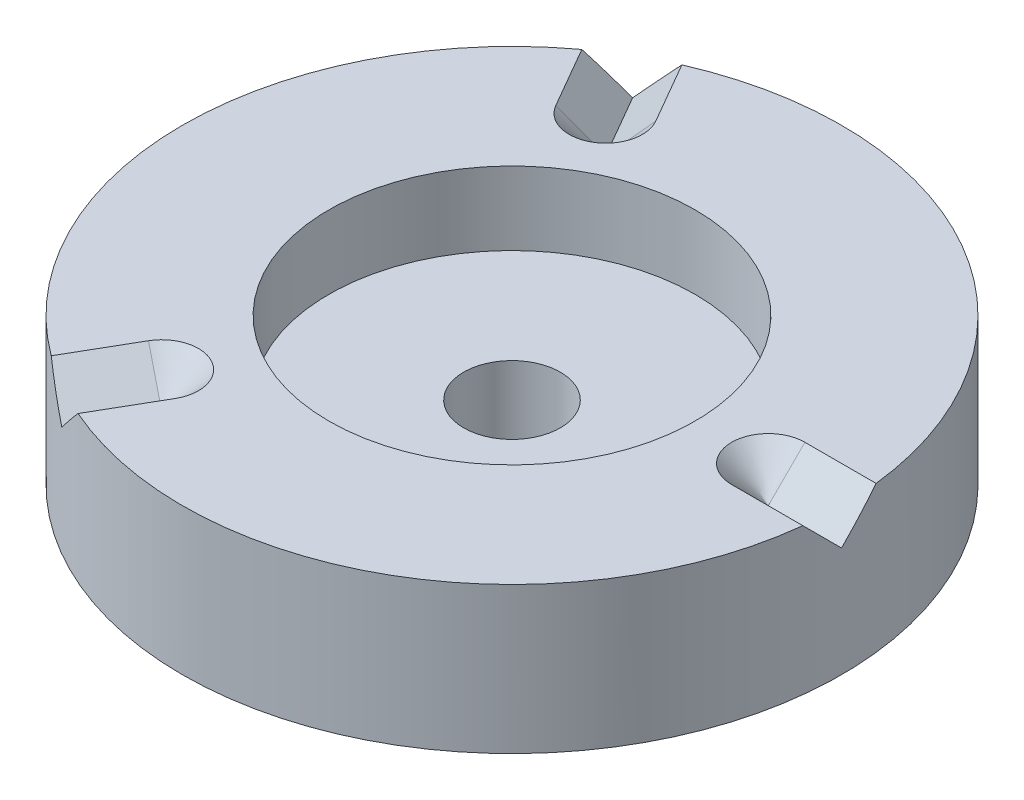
ISO-10303-21;
HEADER;
FILE_DESCRIPTION(('STEP AP214'),'2;1');
FILE_NAME('part.step','',(''),(''),'','','');
FILE_SCHEMA(('AUTOMOTIVE_DESIGN { 1 0 10303 214 1 1 1 1 }'));
ENDSEC;
DATA;
#1=APPLICATION_CONTEXT('core data for automotive mechanical design processes');
#2=APPLICATION_PROTOCOL_DEFINITION('international standard','automotive_design',2000,#1);
#3=PRODUCT_CONTEXT('',#1,'mechanical');
#4=PRODUCT('Part','Part','',(#3));
#5=PRODUCT_RELATED_PRODUCT_CATEGORY('part','',(#4));
#6=PRODUCT_DEFINITION_FORMATION('','',#4);
#7=PRODUCT_DEFINITION_CONTEXT('part definition',#1,'design');
#8=PRODUCT_DEFINITION('design','',#6,#7);
#9=PRODUCT_DEFINITION_SHAPE('','',#8);
#10=(LENGTH_UNIT() NAMED_UNIT(*) SI_UNIT(.MILLI.,.METRE.));
#11=(NAMED_UNIT(*) PLANE_ANGLE_UNIT() SI_UNIT($,.RADIAN.));
#12=(NAMED_UNIT(*) SI_UNIT($,.STERADIAN.) SOLID_ANGLE_UNIT());
#13=UNCERTAINTY_MEASURE_WITH_UNIT(LENGTH_MEASURE(1.E-05),#10,'distance_accuracy_value','');
#14=(GEOMETRIC_REPRESENTATION_CONTEXT(3) GLOBAL_UNCERTAINTY_ASSIGNED_CONTEXT((#13)) GLOBAL_UNIT_ASSIGNED_CONTEXT((#10,
#11,#12)) REPRESENTATION_CONTEXT('',''));
#15=CARTESIAN_POINT('',(0.,0.,0.));
#16=DIRECTION('',(0.,0.,1.));
#17=DIRECTION('',(1.,0.,0.));
#18=AXIS2_PLACEMENT_3D('',#15,#16,#17);
#19=CARTESIAN_POINT('',(0.,10.,0.));
#20=DIRECTION('',(0.,-1.,0.));
#21=DIRECTION('',(0.,0.,-1.));
#22=AXIS2_PLACEMENT_3D('',#19,#20,#21);
#23=CYLINDRICAL_SURFACE('',#22,22.5);
#24=CARTESIAN_POINT('',(0.,10.,0.));
#25=DIRECTION('',(0.,1.,0.));
#26=DIRECTION('',(0.,0.,1.));
#27=AXIS2_PLACEMENT_3D('',#24,#25,#26);
#28=CIRCLE('',#27,22.5);
#29=CARTESIAN_POINT('',(-9.01527637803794,10.,20.614916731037));
#30=VERTEX_POINT('',#29);
#31=CARTESIAN_POINT('',(22.3606797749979,10.,2.5));
#32=VERTEX_POINT('',#31);
#33=EDGE_CURVE('E167',#30,#32,#28,.T.);
#34=ORIENTED_EDGE('',*,*,#33,.F.);
#35=CARTESIAN_POINT('',(0.,7.5,0.));
#36=DIRECTION('',(0.612372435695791,-0.707106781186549,0.353553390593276));
#37=DIRECTION('',(-0.612372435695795,-0.707106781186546,-0.353553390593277));
#38=AXIS2_PLACEMENT_3D('',#35,#36,#37);
#39=ELLIPSE('',#38,31.8198051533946,22.5);
#40=CARTESIAN_POINT('',(-11.2500000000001,7.5,19.4855715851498));
#41=VERTEX_POINT('',#40);
#42=EDGE_CURVE('E127',#30,#41,#39,.T.);
#43=ORIENTED_EDGE('',*,*,#42,.T.);
#44=CARTESIAN_POINT('',(0.,7.5,0.));
#45=DIRECTION('',(-0.612372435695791,-0.707106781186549,-0.353553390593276));
#46=DIRECTION('',(0.612372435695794,-0.707106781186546,0.353553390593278));
#47=AXIS2_PLACEMENT_3D('',#44,#45,#46);
#48=ELLIPSE('',#47,31.8198051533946,22.5);
#49=CARTESIAN_POINT('',(-13.3454033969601,10.,18.114916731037));
#50=VERTEX_POINT('',#49);
#51=EDGE_CURVE('E128',#41,#50,#48,.T.);
#52=ORIENTED_EDGE('',*,*,#51,.T.);
#53=CARTESIAN_POINT('',(-13.3454033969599,10.,-18.1149167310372));
#54=VERTEX_POINT('',#53);
#55=EDGE_CURVE('E165',#54,#50,#28,.T.);
#56=ORIENTED_EDGE('',*,*,#55,.F.);
#57=CARTESIAN_POINT('',(0.,7.5,0.));
#58=DIRECTION('',(-0.612372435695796,-0.707106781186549,0.353553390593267));
#59=DIRECTION('',(0.612372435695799,-0.707106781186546,-0.353553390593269));
#60=AXIS2_PLACEMENT_3D('',#57,#58,#59);
#61=ELLIPSE('',#60,31.8198051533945,22.5);
#62=CARTESIAN_POINT('',(-11.2499999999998,7.5,-19.48557158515));
#63=VERTEX_POINT('',#62);
#64=EDGE_CURVE('E11',#54,#63,#61,.T.);
#65=ORIENTED_EDGE('',*,*,#64,.T.);
#66=CARTESIAN_POINT('',(0.,7.5,0.));
#67=DIRECTION('',(0.612372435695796,-0.707106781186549,-0.353553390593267));
#68=DIRECTION('',(-0.612372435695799,-0.707106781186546,0.353553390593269));
#69=AXIS2_PLACEMENT_3D('',#66,#67,#68);
#70=ELLIPSE('',#69,31.8198051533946,22.5);
#71=CARTESIAN_POINT('',(-9.01527637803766,10.,-20.6149167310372));
#72=VERTEX_POINT('',#71);
#73=EDGE_CURVE('E47',#63,#72,#70,.T.);
#74=ORIENTED_EDGE('',*,*,#73,.T.);
#75=CARTESIAN_POINT('',(22.3606797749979,10.,-2.5));
#76=VERTEX_POINT('',#75);
#77=EDGE_CURVE('E161',#76,#72,#28,.T.);
#78=ORIENTED_EDGE('',*,*,#77,.F.);
#79=CARTESIAN_POINT('',(0.,7.5,0.));
#80=DIRECTION('',(0.,-0.707106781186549,-0.707106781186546));
#81=DIRECTION('',(0.,-0.707106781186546,0.707106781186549));
#82=AXIS2_PLACEMENT_3D('',#79,#80,#81);
#83=ELLIPSE('',#82,31.8198051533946,22.5);
#84=CARTESIAN_POINT('',(22.5,7.5,0.));
#85=VERTEX_POINT('',#84);
#86=EDGE_CURVE('E133',#76,#85,#83,.T.);
#87=ORIENTED_EDGE('',*,*,#86,.T.);
#88=CARTESIAN_POINT('',(0.,7.5,0.));
#89=DIRECTION('',(0.,-0.707106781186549,0.707106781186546));
#90=DIRECTION('',(0.,-0.707106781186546,-0.707106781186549));
#91=AXIS2_PLACEMENT_3D('',#88,#89,#90);
#92=ELLIPSE('',#91,31.8198051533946,22.5);
#93=EDGE_CURVE('E168',#85,#32,#92,.T.);
#94=ORIENTED_EDGE('',*,*,#93,.T.);
#95=EDGE_LOOP('',(#34,#43,#52,#56,#65,#74,#78,#87,#94));
#96=FACE_BOUND('',#95,.T.);
#97=CARTESIAN_POINT('',(0.,0.,0.));
#98=DIRECTION('',(0.,1.,0.));
#99=DIRECTION('',(0.,0.,1.));
#100=AXIS2_PLACEMENT_3D('',#97,#98,#99);
#101=CIRCLE('',#100,22.5);
#102=CARTESIAN_POINT('',(0.,0.,22.5));
#103=VERTEX_POINT('',#102);
#104=EDGE_CURVE('E172',#103,#103,#101,.T.);
#105=ORIENTED_EDGE('',*,*,#104,.T.);
#106=EDGE_LOOP('',(#105));
#107=FACE_BOUND('',#106,.T.);
#108=ADVANCED_FACE('F36',(#96,#107),#23,.T.);
#109=CARTESIAN_POINT('',(0.,10.,0.));
#110=DIRECTION('',(0.,1.,0.));
#111=DIRECTION('',(0.,0.,1.));
#112=AXIS2_PLACEMENT_3D('',#109,#110,#111);
#113=PLANE('',#112);
#114=CARTESIAN_POINT('',(0.,10.,0.));
#115=DIRECTION('',(0.,1.,0.));
#116=DIRECTION('',(0.,0.,1.));
#117=AXIS2_PLACEMENT_3D('',#114,#115,#116);
#118=CIRCLE('',#117,12.5);
#119=CARTESIAN_POINT('',(0.,10.,12.5));
#120=VERTEX_POINT('',#119);
#121=EDGE_CURVE('E199',#120,#120,#118,.T.);
#122=ORIENTED_EDGE('',*,*,#121,.F.);
#123=EDGE_LOOP('',(#122));
#124=FACE_BOUND('',#123,.T.);
#125=DIRECTION('',(-0.500000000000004,0.,0.866025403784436));
#126=VECTOR('',#125,1.);
#127=CARTESIAN_POINT('',(-15.9150635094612,10.,22.565698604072));
#128=LINE('',#127,#126);
#129=CARTESIAN_POINT('',(-10.9150635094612,10.,13.9054445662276));
#130=VERTEX_POINT('',#129);
#131=EDGE_CURVE('E112',#130,#50,#128,.T.);
#132=ORIENTED_EDGE('',*,*,#131,.F.);
#133=CARTESIAN_POINT('',(-8.75000000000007,10.,15.1554445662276));
#134=DIRECTION('',(0.,1.,0.));
#135=DIRECTION('',(-0.866025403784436,0.,-0.500000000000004));
#136=AXIS2_PLACEMENT_3D('',#133,#134,#135);
#137=CIRCLE('',#136,2.5);
#138=CARTESIAN_POINT('',(-6.58493649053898,10.,16.4054445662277));
#139=VERTEX_POINT('',#138);
#140=EDGE_CURVE('E104',#139,#130,#137,.T.);
#141=ORIENTED_EDGE('',*,*,#140,.F.);
#142=DIRECTION('',(0.500000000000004,0.,-0.866025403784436));
#143=VECTOR('',#142,1.);
#144=CARTESIAN_POINT('',(2.16506350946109,10.,1.25000000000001));
#145=LINE('',#144,#143);
#146=EDGE_CURVE('E108',#30,#139,#145,.T.);
#147=ORIENTED_EDGE('',*,*,#146,.F.);
#148=ORIENTED_EDGE('',*,*,#33,.T.);
#149=DIRECTION('',(1.,0.,0.));
#150=VECTOR('',#149,1.);
#151=CARTESIAN_POINT('',(27.5,10.,2.5));
#152=LINE('',#151,#150);
#153=CARTESIAN_POINT('',(17.5,10.,2.5));
#154=VERTEX_POINT('',#153);
#155=EDGE_CURVE('E176',#154,#32,#152,.T.);
#156=ORIENTED_EDGE('',*,*,#155,.F.);
#157=CARTESIAN_POINT('',(17.5,10.,0.));
#158=DIRECTION('',(0.,1.,0.));
#159=DIRECTION('',(0.,0.,1.));
#160=AXIS2_PLACEMENT_3D('',#157,#158,#159);
#161=CIRCLE('',#160,2.5);
#162=CARTESIAN_POINT('',(17.5,10.,-2.5));
#163=VERTEX_POINT('',#162);
#164=EDGE_CURVE('E179',#163,#154,#161,.T.);
#165=ORIENTED_EDGE('',*,*,#164,.F.);
#166=DIRECTION('',(-1.,0.,0.));
#167=VECTOR('',#166,1.);
#168=CARTESIAN_POINT('',(0.,10.,-2.5));
#169=LINE('',#168,#167);
#170=EDGE_CURVE('E164',#76,#163,#169,.T.);
#171=ORIENTED_EDGE('',*,*,#170,.F.);
#172=ORIENTED_EDGE('',*,*,#77,.T.);
#173=DIRECTION('',(-0.499999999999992,0.,-0.866025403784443));
#174=VECTOR('',#173,1.);
#175=CARTESIAN_POINT('',(-11.5849364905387,10.,-25.0656986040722));
#176=LINE('',#175,#174);
#177=CARTESIAN_POINT('',(-6.58493649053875,10.,-16.4054445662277));
#178=VERTEX_POINT('',#177);
#179=EDGE_CURVE('E115',#178,#72,#176,.T.);
#180=ORIENTED_EDGE('',*,*,#179,.F.);
#181=CARTESIAN_POINT('',(-8.74999999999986,10.,-15.1554445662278));
#182=DIRECTION('',(0.,1.,0.));
#183=DIRECTION('',(0.866025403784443,0.,-0.499999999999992));
#184=AXIS2_PLACEMENT_3D('',#181,#182,#183);
#185=CIRCLE('',#184,2.5);
#186=CARTESIAN_POINT('',(-10.915063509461,10.,-13.9054445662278));
#187=VERTEX_POINT('',#186);
#188=EDGE_CURVE('E123',#187,#178,#185,.T.);
#189=ORIENTED_EDGE('',*,*,#188,.F.);
#190=DIRECTION('',(0.499999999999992,0.,0.866025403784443));
#191=VECTOR('',#190,1.);
#192=CARTESIAN_POINT('',(-2.16506350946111,10.,1.24999999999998));
#193=LINE('',#192,#191);
#194=EDGE_CURVE('E129',#54,#187,#193,.T.);
#195=ORIENTED_EDGE('',*,*,#194,.F.);
#196=ORIENTED_EDGE('',*,*,#55,.T.);
#197=EDGE_LOOP('',(#132,#141,#147,#148,#156,#165,#171,#172,#180,#189,#195,#196));
#198=FACE_BOUND('',#197,.T.);
#199=ADVANCED_FACE('F106',(#124,#198),#113,.T.);
#200=CARTESIAN_POINT('',(0.,0.,0.));
#201=DIRECTION('',(0.,1.,0.));
#202=DIRECTION('',(0.,0.,1.));
#203=AXIS2_PLACEMENT_3D('',#200,#201,#202);
#204=PLANE('',#203);
#205=CARTESIAN_POINT('',(0.,0.,0.));
#206=DIRECTION('',(0.,1.,0.));
#207=DIRECTION('',(0.,0.,1.));
#208=AXIS2_PLACEMENT_3D('',#205,#206,#207);
#209=CIRCLE('',#208,3.3);
#210=CARTESIAN_POINT('',(0.,0.,3.3));
#211=VERTEX_POINT('',#210);
#212=EDGE_CURVE('E202',#211,#211,#209,.T.);
#213=ORIENTED_EDGE('',*,*,#212,.T.);
#214=EDGE_LOOP('',(#213));
#215=FACE_BOUND('',#214,.T.);
#216=ORIENTED_EDGE('',*,*,#104,.F.);
#217=EDGE_LOOP('',(#216));
#218=FACE_BOUND('',#217,.T.);
#219=ADVANCED_FACE('F226',(#215,#218),#204,.F.);
#220=CARTESIAN_POINT('',(17.5,9.99999999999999,0.));
#221=DIRECTION('',(0.,1.,0.));
#222=DIRECTION('',(0.,0.,1.));
#223=AXIS2_PLACEMENT_3D('',#220,#221,#222);
#224=CONICAL_SURFACE('',#223,2.50000000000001,0.785398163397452);
#225=DIRECTION('',(0.,-0.707106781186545,0.70710678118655));
#226=VECTOR('',#225,1.);
#227=CARTESIAN_POINT('',(17.5,9.99999999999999,-2.5));
#228=LINE('',#227,#226);
#229=CARTESIAN_POINT('',(17.5,7.5,0.));
#230=VERTEX_POINT('',#229);
#231=EDGE_CURVE('E187',#163,#230,#228,.T.);
#232=ORIENTED_EDGE('',*,*,#231,.F.);
#233=ORIENTED_EDGE('',*,*,#164,.T.);
#234=DIRECTION('',(0.,0.707106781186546,0.707106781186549));
#235=VECTOR('',#234,1.);
#236=CARTESIAN_POINT('',(17.5,7.5,0.));
#237=LINE('',#236,#235);
#238=EDGE_CURVE('E186',#230,#154,#237,.T.);
#239=ORIENTED_EDGE('',*,*,#238,.F.);
#240=EDGE_LOOP('',(#232,#233,#239));
#241=FACE_BOUND('',#240,.T.);
#242=ADVANCED_FACE('F233',(#241),#224,.F.);
#243=CARTESIAN_POINT('',(27.5,7.5,0.));
#244=DIRECTION('',(0.,-0.707106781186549,-0.707106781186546));
#245=DIRECTION('',(-1.,0.,0.));
#246=AXIS2_PLACEMENT_3D('',#243,#244,#245);
#247=PLANE('',#246);
#248=ORIENTED_EDGE('',*,*,#170,.T.);
#249=ORIENTED_EDGE('',*,*,#231,.T.);
#250=DIRECTION('',(-1.,0.,0.));
#251=VECTOR('',#250,1.);
#252=CARTESIAN_POINT('',(27.5,7.5,0.));
#253=LINE('',#252,#251);
#254=EDGE_CURVE('E183',#85,#230,#253,.T.);
#255=ORIENTED_EDGE('',*,*,#254,.F.);
#256=ORIENTED_EDGE('',*,*,#86,.F.);
#257=EDGE_LOOP('',(#248,#249,#255,#256));
#258=FACE_BOUND('',#257,.T.);
#259=ADVANCED_FACE('F247',(#258),#247,.F.);
#260=CARTESIAN_POINT('',(27.5,7.5,0.));
#261=DIRECTION('',(0.,-0.707106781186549,0.707106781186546));
#262=DIRECTION('',(1.,0.,0.));
#263=AXIS2_PLACEMENT_3D('',#260,#261,#262);
#264=PLANE('',#263);
#265=ORIENTED_EDGE('',*,*,#238,.T.);
#266=ORIENTED_EDGE('',*,*,#155,.T.);
#267=ORIENTED_EDGE('',*,*,#93,.F.);
#268=ORIENTED_EDGE('',*,*,#254,.T.);
#269=EDGE_LOOP('',(#265,#266,#267,#268));
#270=FACE_BOUND('',#269,.T.);
#271=ADVANCED_FACE('F240',(#270),#264,.F.);
#272=CARTESIAN_POINT('',(-8.75000000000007,9.99999999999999,15.1554445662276));
#273=DIRECTION('',(0.,1.,0.));
#274=DIRECTION('',(0.,0.,1.));
#275=AXIS2_PLACEMENT_3D('',#272,#273,#274);
#276=CONICAL_SURFACE('',#275,2.50000000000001,0.785398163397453);
#277=DIRECTION('',(-0.612372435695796,-0.707106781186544,-0.353553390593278));
#278=VECTOR('',#277,1.);
#279=CARTESIAN_POINT('',(-6.58493649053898,9.99999999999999,16.4054445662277));
#280=LINE('',#279,#278);
#281=CARTESIAN_POINT('',(-8.75000000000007,7.5,15.1554445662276));
#282=VERTEX_POINT('',#281);
#283=EDGE_CURVE('E117',#139,#282,#280,.T.);
#284=ORIENTED_EDGE('',*,*,#283,.F.);
#285=ORIENTED_EDGE('',*,*,#140,.T.);
#286=DIRECTION('',(-0.612372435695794,0.707106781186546,-0.353553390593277));
#287=VECTOR('',#286,1.);
#288=CARTESIAN_POINT('',(-8.75000000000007,7.5,15.1554445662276));
#289=LINE('',#288,#287);
#290=EDGE_CURVE('E119',#282,#130,#289,.T.);
#291=ORIENTED_EDGE('',*,*,#290,.F.);
#292=EDGE_LOOP('',(#284,#285,#291));
#293=FACE_BOUND('',#292,.T.);
#294=ADVANCED_FACE('F118',(#293),#276,.F.);
#295=CARTESIAN_POINT('',(-13.7500000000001,7.5,23.815698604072));
#296=DIRECTION('',(0.612372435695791,-0.707106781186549,0.353553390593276));
#297=DIRECTION('',(0.500000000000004,0.,-0.866025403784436));
#298=AXIS2_PLACEMENT_3D('',#295,#296,#297);
#299=PLANE('',#298);
#300=ORIENTED_EDGE('',*,*,#146,.T.);
#301=ORIENTED_EDGE('',*,*,#283,.T.);
#302=DIRECTION('',(0.500000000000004,0.,-0.866025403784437));
#303=VECTOR('',#302,1.);
#304=CARTESIAN_POINT('',(-13.7500000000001,7.5,23.815698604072));
#305=LINE('',#304,#303);
#306=EDGE_CURVE('E138',#41,#282,#305,.T.);
#307=ORIENTED_EDGE('',*,*,#306,.F.);
#308=ORIENTED_EDGE('',*,*,#42,.F.);
#309=EDGE_LOOP('',(#300,#301,#307,#308));
#310=FACE_BOUND('',#309,.T.);
#311=ADVANCED_FACE('F126',(#310),#299,.F.);
#312=CARTESIAN_POINT('',(-13.7500000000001,7.5,23.815698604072));
#313=DIRECTION('',(-0.612372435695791,-0.707106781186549,-0.353553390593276));
#314=DIRECTION('',(-0.500000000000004,0.,0.866025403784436));
#315=AXIS2_PLACEMENT_3D('',#312,#313,#314);
#316=PLANE('',#315);
#317=ORIENTED_EDGE('',*,*,#290,.T.);
#318=ORIENTED_EDGE('',*,*,#131,.T.);
#319=ORIENTED_EDGE('',*,*,#51,.F.);
#320=ORIENTED_EDGE('',*,*,#306,.T.);
#321=EDGE_LOOP('',(#317,#318,#319,#320));
#322=FACE_BOUND('',#321,.T.);
#323=ADVANCED_FACE('F259',(#322),#316,.F.);
#324=CARTESIAN_POINT('',(-8.74999999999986,9.99999999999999,-15.1554445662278));
#325=DIRECTION('',(0.,1.,0.));
#326=DIRECTION('',(0.,0.,1.));
#327=AXIS2_PLACEMENT_3D('',#324,#325,#326);
#328=CONICAL_SURFACE('',#327,2.50000000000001,0.785398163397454);
#329=DIRECTION('',(0.612372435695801,-0.707106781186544,-0.35355339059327));
#330=VECTOR('',#329,1.);
#331=CARTESIAN_POINT('',(-10.915063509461,9.99999999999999,-13.9054445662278));
#332=LINE('',#331,#330);
#333=CARTESIAN_POINT('',(-8.74999999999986,7.5,-15.1554445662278));
#334=VERTEX_POINT('',#333);
#335=EDGE_CURVE('E41',#187,#334,#332,.T.);
#336=ORIENTED_EDGE('',*,*,#335,.F.);
#337=ORIENTED_EDGE('',*,*,#188,.T.);
#338=DIRECTION('',(0.612372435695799,0.707106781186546,-0.353553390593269));
#339=VECTOR('',#338,1.);
#340=CARTESIAN_POINT('',(-8.74999999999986,7.5,-15.1554445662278));
#341=LINE('',#340,#339);
#342=EDGE_CURVE('E144',#334,#178,#341,.T.);
#343=ORIENTED_EDGE('',*,*,#342,.F.);
#344=EDGE_LOOP('',(#336,#337,#343));
#345=FACE_BOUND('',#344,.T.);
#346=ADVANCED_FACE('F39',(#345),#328,.F.);
#347=CARTESIAN_POINT('',(-13.7499999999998,7.5,-23.8156986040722));
#348=DIRECTION('',(-0.612372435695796,-0.707106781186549,0.353553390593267));
#349=DIRECTION('',(0.499999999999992,0.,0.866025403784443));
#350=AXIS2_PLACEMENT_3D('',#347,#348,#349);
#351=PLANE('',#350);
#352=ORIENTED_EDGE('',*,*,#194,.T.);
#353=ORIENTED_EDGE('',*,*,#335,.T.);
#354=DIRECTION('',(0.499999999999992,0.,0.866025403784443));
#355=VECTOR('',#354,1.);
#356=CARTESIAN_POINT('',(-13.7499999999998,7.5,-23.8156986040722));
#357=LINE('',#356,#355);
#358=EDGE_CURVE('E142',#63,#334,#357,.T.);
#359=ORIENTED_EDGE('',*,*,#358,.F.);
#360=ORIENTED_EDGE('',*,*,#64,.F.);
#361=EDGE_LOOP('',(#352,#353,#359,#360));
#362=FACE_BOUND('',#361,.T.);
#363=ADVANCED_FACE('F153',(#362),#351,.F.);
#364=CARTESIAN_POINT('',(-13.7499999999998,7.5,-23.8156986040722));
#365=DIRECTION('',(0.612372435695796,-0.707106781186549,-0.353553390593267));
#366=DIRECTION('',(-0.499999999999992,0.,-0.866025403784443));
#367=AXIS2_PLACEMENT_3D('',#364,#365,#366);
#368=PLANE('',#367);
#369=ORIENTED_EDGE('',*,*,#342,.T.);
#370=ORIENTED_EDGE('',*,*,#179,.T.);
#371=ORIENTED_EDGE('',*,*,#73,.F.);
#372=ORIENTED_EDGE('',*,*,#358,.T.);
#373=EDGE_LOOP('',(#369,#370,#371,#372));
#374=FACE_BOUND('',#373,.T.);
#375=ADVANCED_FACE('F157',(#374),#368,.F.);
#376=CARTESIAN_POINT('',(0.,5.,0.));
#377=DIRECTION('',(0.,1.,0.));
#378=DIRECTION('',(0.,0.,1.));
#379=AXIS2_PLACEMENT_3D('',#376,#377,#378);
#380=CYLINDRICAL_SURFACE('',#379,12.5);
#381=CARTESIAN_POINT('',(0.,5.,0.));
#382=DIRECTION('',(0.,1.,0.));
#383=DIRECTION('',(0.,0.,1.));
#384=AXIS2_PLACEMENT_3D('',#381,#382,#383);
#385=CIRCLE('',#384,12.5);
#386=CARTESIAN_POINT('',(0.,5.,12.5));
#387=VERTEX_POINT('',#386);
#388=EDGE_CURVE('E145',#387,#387,#385,.T.);
#389=ORIENTED_EDGE('',*,*,#388,.F.);
#390=EDGE_LOOP('',(#389));
#391=FACE_BOUND('',#390,.T.);
#392=ORIENTED_EDGE('',*,*,#121,.T.);
#393=EDGE_LOOP('',(#392));
#394=FACE_BOUND('',#393,.T.);
#395=ADVANCED_FACE('F216',(#391,#394),#380,.F.);
#396=CARTESIAN_POINT('',(0.,5.,0.));
#397=DIRECTION('',(0.,1.,0.));
#398=DIRECTION('',(0.,0.,1.));
#399=AXIS2_PLACEMENT_3D('',#396,#397,#398);
#400=PLANE('',#399);
#401=CARTESIAN_POINT('',(0.,5.,0.));
#402=DIRECTION('',(0.,1.,0.));
#403=DIRECTION('',(0.,0.,1.));
#404=AXIS2_PLACEMENT_3D('',#401,#402,#403);
#405=CIRCLE('',#404,3.3);
#406=CARTESIAN_POINT('',(0.,5.,3.3));
#407=VERTEX_POINT('',#406);
#408=EDGE_CURVE('E207',#407,#407,#405,.T.);
#409=ORIENTED_EDGE('',*,*,#408,.F.);
#410=EDGE_LOOP('',(#409));
#411=FACE_BOUND('',#410,.T.);
#412=ORIENTED_EDGE('',*,*,#388,.T.);
#413=EDGE_LOOP('',(#412));
#414=FACE_BOUND('',#413,.T.);
#415=ADVANCED_FACE('F213',(#411,#414),#400,.T.);
#416=CARTESIAN_POINT('',(0.,5.,0.));
#417=DIRECTION('',(0.,1.,0.));
#418=DIRECTION('',(0.,0.,1.));
#419=AXIS2_PLACEMENT_3D('',#416,#417,#418);
#420=CYLINDRICAL_SURFACE('',#419,3.3);
#421=ORIENTED_EDGE('',*,*,#212,.F.);
#422=EDGE_LOOP('',(#421));
#423=FACE_BOUND('',#422,.T.);
#424=ORIENTED_EDGE('',*,*,#408,.T.);
#425=EDGE_LOOP('',(#424));
#426=FACE_BOUND('',#425,.T.);
#427=ADVANCED_FACE('F211',(#423,#426),#420,.F.);
#428=CLOSED_SHELL('',(#108,#199,#219,#242,#259,#271,#294,#311,#323,#346,#363,#375,#395,#415,#427));
#429=MANIFOLD_SOLID_BREP('B2',#428);
#430=ADVANCED_BREP_SHAPE_REPRESENTATION('',(#18,#429),#14);
#431=SHAPE_DEFINITION_REPRESENTATION(#9,#430);
ENDSEC;
END-ISO-10303-21;
